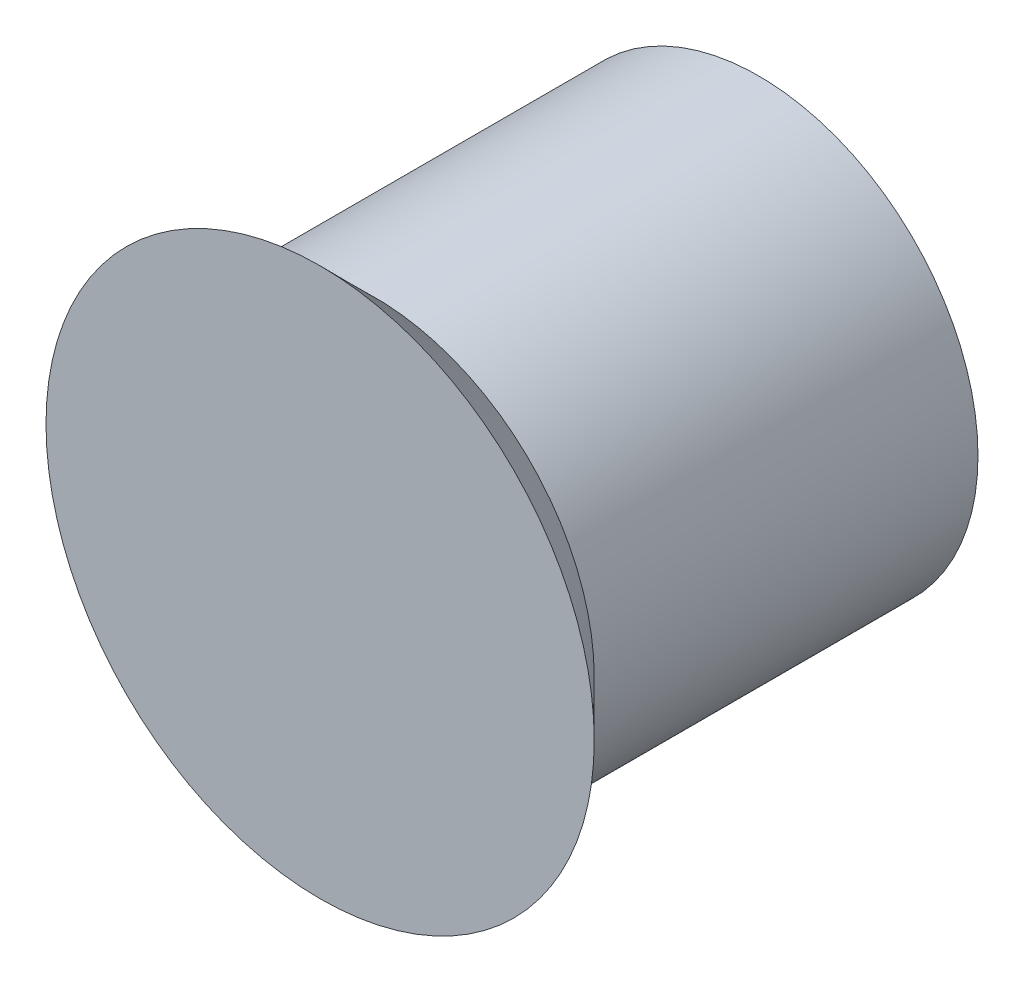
ISO-10303-21;
HEADER;
FILE_DESCRIPTION(('STEP AP214'),'2;1');
FILE_NAME('part.step','',(''),(''),'','','');
FILE_SCHEMA(('AUTOMOTIVE_DESIGN { 1 0 10303 214 1 1 1 1 }'));
ENDSEC;
DATA;
#1=APPLICATION_CONTEXT('core data for automotive mechanical design processes');
#2=APPLICATION_PROTOCOL_DEFINITION('international standard','automotive_design',2000,#1);
#3=PRODUCT_CONTEXT('',#1,'mechanical');
#4=PRODUCT('Part','Part','',(#3));
#5=PRODUCT_RELATED_PRODUCT_CATEGORY('part','',(#4));
#6=PRODUCT_DEFINITION_FORMATION('','',#4);
#7=PRODUCT_DEFINITION_CONTEXT('part definition',#1,'design');
#8=PRODUCT_DEFINITION('design','',#6,#7);
#9=PRODUCT_DEFINITION_SHAPE('','',#8);
#10=(LENGTH_UNIT() NAMED_UNIT(*) SI_UNIT(.MILLI.,.METRE.));
#11=(NAMED_UNIT(*) PLANE_ANGLE_UNIT() SI_UNIT($,.RADIAN.));
#12=(NAMED_UNIT(*) SI_UNIT($,.STERADIAN.) SOLID_ANGLE_UNIT());
#13=UNCERTAINTY_MEASURE_WITH_UNIT(LENGTH_MEASURE(1.E-05),#10,'distance_accuracy_value','');
#14=(GEOMETRIC_REPRESENTATION_CONTEXT(3) GLOBAL_UNCERTAINTY_ASSIGNED_CONTEXT((#13)) GLOBAL_UNIT_ASSIGNED_CONTEXT((#10,
#11,#12)) REPRESENTATION_CONTEXT('',''));
#15=CARTESIAN_POINT('',(0.,0.,0.));
#16=DIRECTION('',(0.,0.,1.));
#17=DIRECTION('',(1.,0.,0.));
#18=AXIS2_PLACEMENT_3D('',#15,#16,#17);
#19=CARTESIAN_POINT('',(0.,0.,7.));
#20=DIRECTION('',(0.,0.,-1.));
#21=DIRECTION('',(-1.,0.,0.));
#22=AXIS2_PLACEMENT_3D('',#19,#20,#21);
#23=CYLINDRICAL_SURFACE('',#22,4.);
#24=CARTESIAN_POINT('',(0.,0.,7.));
#25=DIRECTION('',(0.,0.,1.));
#26=DIRECTION('',(1.,0.,0.));
#27=AXIS2_PLACEMENT_3D('',#24,#25,#26);
#28=CIRCLE('',#27,4.);
#29=CARTESIAN_POINT('',(4.,0.,7.));
#30=VERTEX_POINT('',#29);
#31=EDGE_CURVE('E10',#30,#30,#28,.T.);
#32=ORIENTED_EDGE('',*,*,#31,.F.);
#33=EDGE_LOOP('',(#32));
#34=FACE_BOUND('',#33,.T.);
#35=CARTESIAN_POINT('',(0.,0.,0.));
#36=DIRECTION('',(0.,0.,1.));
#37=DIRECTION('',(1.,0.,0.));
#38=AXIS2_PLACEMENT_3D('',#35,#36,#37);
#39=CIRCLE('',#38,4.);
#40=CARTESIAN_POINT('',(4.,0.,0.));
#41=VERTEX_POINT('',#40);
#42=EDGE_CURVE('E34',#41,#41,#39,.T.);
#43=ORIENTED_EDGE('',*,*,#42,.T.);
#44=EDGE_LOOP('',(#43));
#45=FACE_BOUND('',#44,.T.);
#46=ADVANCED_FACE('F31',(#34,#45),#23,.T.);
#47=CARTESIAN_POINT('',(0.,0.,0.));
#48=DIRECTION('',(0.,0.,1.));
#49=DIRECTION('',(1.,0.,0.));
#50=AXIS2_PLACEMENT_3D('',#47,#48,#49);
#51=PLANE('',#50);
#52=ORIENTED_EDGE('',*,*,#42,.F.);
#53=EDGE_LOOP('',(#52));
#54=FACE_BOUND('',#53,.T.);
#55=ADVANCED_FACE('F50',(#54),#51,.F.);
#56=CARTESIAN_POINT('',(0.,0.,7.));
#57=DIRECTION('',(0.,0.,1.));
#58=DIRECTION('',(1.,0.,0.));
#59=AXIS2_PLACEMENT_3D('',#56,#57,#58);
#60=CONICAL_SURFACE('',#59,4.,0.78539816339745);
#61=CARTESIAN_POINT('',(0.,0.,8.));
#62=DIRECTION('',(0.,0.,1.));
#63=DIRECTION('',(1.,0.,0.));
#64=AXIS2_PLACEMENT_3D('',#61,#62,#63);
#65=CIRCLE('',#64,5.);
#66=CARTESIAN_POINT('',(5.,0.,8.));
#67=VERTEX_POINT('',#66);
#68=EDGE_CURVE('E41',#67,#67,#65,.T.);
#69=ORIENTED_EDGE('',*,*,#68,.F.);
#70=EDGE_LOOP('',(#69));
#71=FACE_BOUND('',#70,.T.);
#72=ORIENTED_EDGE('',*,*,#31,.T.);
#73=EDGE_LOOP('',(#72));
#74=FACE_BOUND('',#73,.T.);
#75=ADVANCED_FACE('F48',(#71,#74),#60,.T.);
#76=CARTESIAN_POINT('',(0.,0.,8.));
#77=DIRECTION('',(0.,0.,1.));
#78=DIRECTION('',(1.,0.,0.));
#79=AXIS2_PLACEMENT_3D('',#76,#77,#78);
#80=PLANE('',#79);
#81=ORIENTED_EDGE('',*,*,#68,.T.);
#82=EDGE_LOOP('',(#81));
#83=FACE_BOUND('',#82,.T.);
#84=ADVANCED_FACE('F46',(#83),#80,.T.);
#85=CLOSED_SHELL('',(#46,#55,#75,#84));
#86=MANIFOLD_SOLID_BREP('B2',#85);
#87=ADVANCED_BREP_SHAPE_REPRESENTATION('',(#18,#86),#14);
#88=SHAPE_DEFINITION_REPRESENTATION(#9,#87);
ENDSEC;
END-ISO-10303-21;
